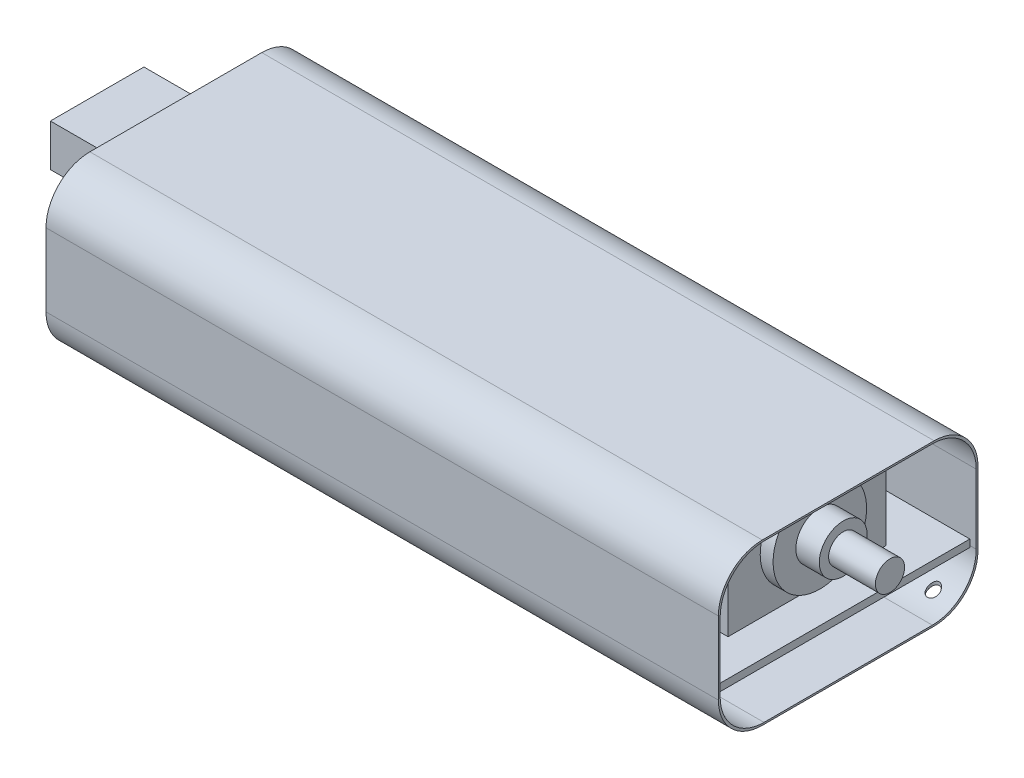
from build123d import *

# Parameters (mm, degrees)
SKETCH1_W            = 145.034
SKETCH1_H            = 54.991
BASE_EXTRUDE_DEPTH   = 1.6002
SKETCH2_W            = 87.884
SKETCH2_H            = 54.991
BOSS_EXTRUDE1_DEPTH  = 12.7
CONN_COMM_DEPTH      = 17.018
CONN_COMM_DEPTH_BACK = 6.35
SKETCH16_W           = 20.32
SKETCH16_H           = 9.144
SKETCH17_W           = 5.08
SKETCH17_H           = 10.16
CONN_PINS_DEPTH      = 16.51
SKETCH17_W_2         = 7.62
SKETCH17_H_2         = 2.54
CONN_PINS_2_DEPTH    = 16.51
SKETCH14_W           = 20.052826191
SKETCH14_H           = 12.7
COILS_DEPTH          = 9.525
SKETCH3_W            = 12.446
SKETCH3_H            = 34.29
BOSS_EXTRUDE2_DEPTH  = 22.606
SHIELD_DEPTH         = 146.05
SKETCH18_R           = 1.27
CUT_EXTRUDE1_DEPTH   = 6.35


with BuildPart() as part:
    # Sketch1 → Base-Extrude (new body)
    with BuildSketch(Plane(origin=(0, 0, 0), x_dir=(1, 0, 0), z_dir=(0, 1, 0))):
        with Locations((72.517, 27.4955)):
            Rectangle(SKETCH1_W, SKETCH1_H)
    extrude(amount=BASE_EXTRUDE_DEPTH)

    # Sketch2 → Boss-Extrude1 (add)
    with BuildSketch(Plane(origin=(0, 1.6002, 0), x_dir=(-1, 0, 0), z_dir=(0, 1, 0))):
        with Locations((-43.942, -27.4955)):
            Rectangle(SKETCH2_W, SKETCH2_H)
    extrude(amount=BOSS_EXTRUDE1_DEPTH)

    # Sketch16 → Conn Comm (add, two sides: drawn at the far end of the back side and taken through both)
    with BuildSketch(Plane.ZY.offset(-CONN_COMM_DEPTH_BACK)):
        with Locations((-27.4955, 13.462)):
            Rectangle(SKETCH16_W, SKETCH16_H)
    extrude(amount=CONN_COMM_DEPTH + CONN_COMM_DEPTH_BACK)

    # Sketch14 → Coils (add)
    with BuildSketch(Plane.XZ):
        with Locations((67.762988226, -14.403423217)):
            Rectangle(SKETCH14_W, SKETCH14_H)
        with Locations((67.762988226, -38.458362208)):
            Rectangle(SKETCH14_W, SKETCH14_H)
    extrude(amount=COILS_DEPTH)

    # Sketch3 → Boss-Extrude2 (add)
    with BuildSketch(Plane(origin=(0, 1.6002, 0), x_dir=(-1, 0, 0), z_dir=(0, 1, 0))):
        with Locations((-130.937, -27.4955)):
            Rectangle(SKETCH3_W, SKETCH3_H)
    extrude(amount=BOSS_EXTRUDE2_DEPTH)

    # Sketch4 → Boss-Revolve1 (revolve)
    with BuildSketch(Plane(origin=(0, 13.5382, 0), x_dir=(-1, 0, 0), z_dir=(0, 1, 0)), mode=Mode.PRIVATE) as boss_revolve1_sk:
        Polygon((-155.194, -27.4955), (-155.194, -30.6705), (-145.034, -30.6705), (-145.034, -32.7025), (-139.954, -32.7025), (-139.954, -37.6555), (-137.16, -37.6555), (-137.16, -27.4955), align=None)
    revolve(boss_revolve1_sk.sketch.rotate(Axis((137.16, 13.5382, -27.4955), (1, 0, 0)), 180), axis=Axis((137.16, 13.5382, -27.4955), (1, 0, 0)))

    # Sketch5 → Boss-Revolve2 (revolve)
    with BuildSketch(Plane(origin=(0, 13.5382, 0), x_dir=(-1, 0, 0), z_dir=(0, 1, 0))):
        Polygon((-124.714, -27.4955), (-124.714, -36.3855), (-122.936, -36.3855), (-122.936, -38.6715), (-105.918, -38.6715), (-105.918, -31.9405), (-96.393, -31.9405), (-96.393, -27.4955), align=None)
    revolve(axis=Axis((124.714, 13.5382, -27.4955), (-1, 0, 0)))



with BuildPart() as body_2:
    # Sketch17 → Conn Pins (new body)
    with BuildSketch(Plane(origin=(0, 1.6002, 0), x_dir=(-1, 0, 0), z_dir=(0, 1, 0))):
        with Locations((-5.08, -47.371)):
            Rectangle(SKETCH17_W, SKETCH17_H)
    extrude(amount=CONN_PINS_DEPTH)


with BuildPart() as body_3:
    # Sketch17 → Conn Pins 2 (new body)
    with BuildSketch(Plane(origin=(0, 1.6002, 0), x_dir=(-1, 0, 0), z_dir=(0, 1, 0))):
        with Locations((-36.83, -6.35)):
            Rectangle(SKETCH17_W_2, SKETCH17_H_2)
    extrude(amount=CONN_PINS_2_DEPTH)


with BuildPart() as part_1:
    add(part.part)

    add(body_3.part)  # Shield merges body 3

    add(body_2.part)  # Shield merges body 2
    # Sketch7 → Shield (add)
    with BuildSketch(Plane(origin=(0, 0, 0), x_dir=(0, 0, -1), z_dir=(1, 0, 0))):
        with BuildLine():
            Line((8.89, 24.9682), (46.228, 24.9682))
            ThreePointArc((46.228, 24.9682), (52.963192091, 22.178392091), (55.753, 15.4432))
            Line((55.753, 15.4432), (55.753, -0.381))
            ThreePointArc((55.753, -0.381), (52.963192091, -7.116192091), (46.228, -9.906))
            Line((46.228, -9.906), (8.89, -9.906))
            ThreePointArc((8.89, -9.906), (2.154807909, -7.116192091), (-0.635, -0.381))
            Line((-0.635, -0.381), (-0.635, 15.4432))
            ThreePointArc((-0.635, 15.4432), (2.154807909, 22.178392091), (8.89, 24.9682))
        make_face()
        with BuildLine():
            Line((9.271, 24.5872), (45.847, 24.5872))
            ThreePointArc((45.847, 24.5872), (52.582192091, 21.797392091), (55.372, 15.0622))
            Line((55.372, 15.0622), (55.372, 0))
            ThreePointArc((55.372, 0), (52.582192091, -6.735192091), (45.847, -9.525))
            Line((45.847, -9.525), (9.271, -9.525))
            ThreePointArc((9.271, -9.525), (2.535807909, -6.735192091), (-0.254, 0))
            Line((-0.254, 0), (-0.254, 15.0622))
            ThreePointArc((-0.254, 15.0622), (2.535807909, 21.797392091), (9.271, 24.5872))
        make_face(mode=Mode.SUBTRACT)
    extrude(amount=SHIELD_DEPTH)

    # Sketch18 → Cut-Extrude1 (cut)
    with BuildSketch(Plane.XZ.offset(9.906)):
        with Locations(Location((3.937, -50.9905, 0), (0, 0, 270))):
            Circle(SKETCH18_R)
        with Locations(Location((141.097, -50.9905, 0), (0, 0, 270))):
            Circle(SKETCH18_R)
        with Locations(Location((141.097, -4.0005, 0), (0, 0, 270))):
            Circle(SKETCH18_R)
        with Locations(Location((3.937, -4.0005, 0), (0, 0, 270))):
            Circle(SKETCH18_R)
    extrude(amount=-CUT_EXTRUDE1_DEPTH, mode=Mode.SUBTRACT)


solid = part_1.part
